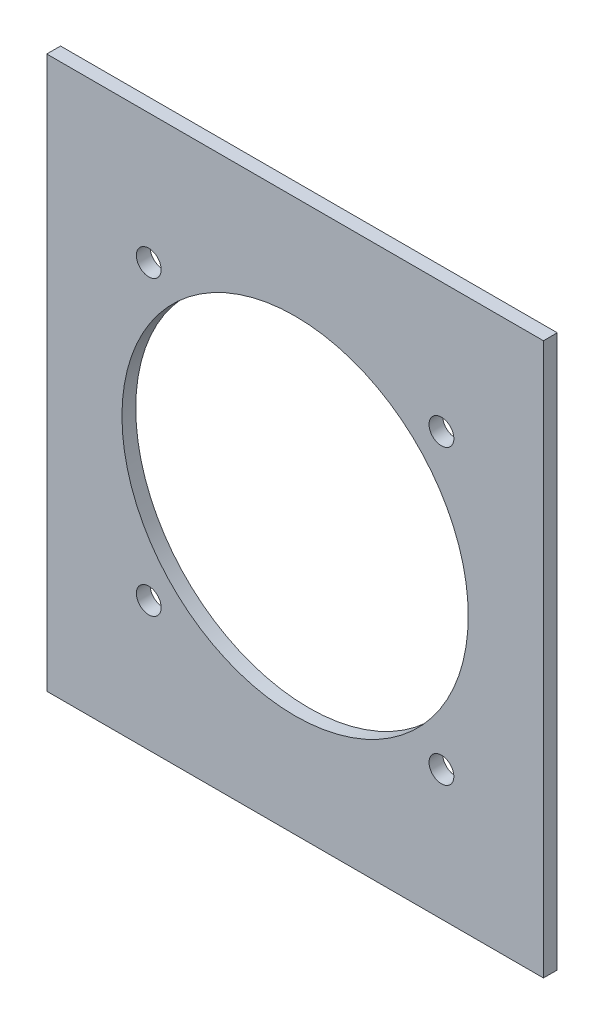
ISO-10303-21;
HEADER;
FILE_DESCRIPTION(('STEP AP214'),'2;1');
FILE_NAME('part.step','',(''),(''),'','','');
FILE_SCHEMA(('AUTOMOTIVE_DESIGN { 1 0 10303 214 1 1 1 1 }'));
ENDSEC;
DATA;
#1=APPLICATION_CONTEXT('core data for automotive mechanical design processes');
#2=APPLICATION_PROTOCOL_DEFINITION('international standard','automotive_design',2000,#1);
#3=PRODUCT_CONTEXT('',#1,'mechanical');
#4=PRODUCT('Part','Part','',(#3));
#5=PRODUCT_RELATED_PRODUCT_CATEGORY('part','',(#4));
#6=PRODUCT_DEFINITION_FORMATION('','',#4);
#7=PRODUCT_DEFINITION_CONTEXT('part definition',#1,'design');
#8=PRODUCT_DEFINITION('design','',#6,#7);
#9=PRODUCT_DEFINITION_SHAPE('','',#8);
#10=(LENGTH_UNIT() NAMED_UNIT(*) SI_UNIT(.MILLI.,.METRE.));
#11=(NAMED_UNIT(*) PLANE_ANGLE_UNIT() SI_UNIT($,.RADIAN.));
#12=(NAMED_UNIT(*) SI_UNIT($,.STERADIAN.) SOLID_ANGLE_UNIT());
#13=UNCERTAINTY_MEASURE_WITH_UNIT(LENGTH_MEASURE(1.E-05),#10,'distance_accuracy_value','');
#14=(GEOMETRIC_REPRESENTATION_CONTEXT(3) GLOBAL_UNCERTAINTY_ASSIGNED_CONTEXT((#13)) GLOBAL_UNIT_ASSIGNED_CONTEXT((#10,
#11,#12)) REPRESENTATION_CONTEXT('',''));
#15=CARTESIAN_POINT('',(0.,0.,0.));
#16=DIRECTION('',(0.,0.,1.));
#17=DIRECTION('',(1.,0.,0.));
#18=AXIS2_PLACEMENT_3D('',#15,#16,#17);
#19=CARTESIAN_POINT('',(-180.,-200.,9.99999999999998));
#20=DIRECTION('',(0.,0.,1.));
#21=DIRECTION('',(1.,0.,0.));
#22=AXIS2_PLACEMENT_3D('',#19,#20,#21);
#23=PLANE('',#22);
#24=CARTESIAN_POINT('',(-106.066017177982,-106.066017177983,9.9999999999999));
#25=DIRECTION('',(0.,0.,1.));
#26=DIRECTION('',(1.,0.,0.));
#27=AXIS2_PLACEMENT_3D('',#24,#25,#26);
#28=CIRCLE('',#27,8.99999999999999);
#29=CARTESIAN_POINT('',(-115.066017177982,-106.066017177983,9.9999999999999));
#30=VERTEX_POINT('',#29);
#31=EDGE_CURVE('E129',#30,#30,#28,.T.);
#32=ORIENTED_EDGE('',*,*,#31,.F.);
#33=EDGE_LOOP('',(#32));
#34=FACE_BOUND('',#33,.T.);
#35=CARTESIAN_POINT('',(106.066017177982,106.066017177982,10.0000000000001));
#36=DIRECTION('',(0.,0.,1.));
#37=DIRECTION('',(1.,0.,0.));
#38=AXIS2_PLACEMENT_3D('',#35,#36,#37);
#39=CIRCLE('',#38,8.99999999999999);
#40=CARTESIAN_POINT('',(97.0660171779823,106.066017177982,10.0000000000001));
#41=VERTEX_POINT('',#40);
#42=EDGE_CURVE('E143',#41,#41,#39,.T.);
#43=ORIENTED_EDGE('',*,*,#42,.F.);
#44=EDGE_LOOP('',(#43));
#45=FACE_BOUND('',#44,.T.);
#46=DIRECTION('',(0.,-1.,0.));
#47=VECTOR('',#46,1.);
#48=CARTESIAN_POINT('',(-180.,200.,9.99999999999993));
#49=LINE('',#48,#47);
#50=CARTESIAN_POINT('',(-180.,200.,9.99999999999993));
#51=VERTEX_POINT('',#50);
#52=CARTESIAN_POINT('',(-180.,-200.,9.99999999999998));
#53=VERTEX_POINT('',#52);
#54=EDGE_CURVE('E99',#51,#53,#49,.T.);
#55=ORIENTED_EDGE('',*,*,#54,.T.);
#56=DIRECTION('',(1.,0.,0.));
#57=VECTOR('',#56,1.);
#58=CARTESIAN_POINT('',(-180.,-200.,9.99999999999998));
#59=LINE('',#58,#57);
#60=CARTESIAN_POINT('',(180.,-200.,10.0000000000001));
#61=VERTEX_POINT('',#60);
#62=EDGE_CURVE('E84',#53,#61,#59,.T.);
#63=ORIENTED_EDGE('',*,*,#62,.T.);
#64=DIRECTION('',(0.,1.,0.));
#65=VECTOR('',#64,1.);
#66=CARTESIAN_POINT('',(180.,200.,10.0000000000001));
#67=LINE('',#66,#65);
#68=CARTESIAN_POINT('',(180.,200.,10.0000000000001));
#69=VERTEX_POINT('',#68);
#70=EDGE_CURVE('E50',#61,#69,#67,.T.);
#71=ORIENTED_EDGE('',*,*,#70,.T.);
#72=DIRECTION('',(-1.,0.,0.));
#73=VECTOR('',#72,1.);
#74=CARTESIAN_POINT('',(-180.,200.,9.99999999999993));
#75=LINE('',#74,#73);
#76=EDGE_CURVE('E45',#69,#51,#75,.T.);
#77=ORIENTED_EDGE('',*,*,#76,.T.);
#78=EDGE_LOOP('',(#55,#63,#71,#77));
#79=FACE_BOUND('',#78,.T.);
#80=CARTESIAN_POINT('',(0.,0.,10.));
#81=DIRECTION('',(0.,0.,1.));
#82=DIRECTION('',(1.,0.,0.));
#83=AXIS2_PLACEMENT_3D('',#80,#81,#82);
#84=CIRCLE('',#83,125.5);
#85=CARTESIAN_POINT('',(-125.5,0.,10.));
#86=VERTEX_POINT('',#85);
#87=EDGE_CURVE('E89',#86,#86,#84,.T.);
#88=ORIENTED_EDGE('',*,*,#87,.F.);
#89=EDGE_LOOP('',(#88));
#90=FACE_BOUND('',#89,.T.);
#91=CARTESIAN_POINT('',(-106.066017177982,106.066017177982,9.99999999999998));
#92=DIRECTION('',(0.,0.,1.));
#93=DIRECTION('',(1.,0.,0.));
#94=AXIS2_PLACEMENT_3D('',#91,#92,#93);
#95=CIRCLE('',#94,8.99999999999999);
#96=CARTESIAN_POINT('',(-115.066017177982,106.066017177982,9.99999999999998));
#97=VERTEX_POINT('',#96);
#98=EDGE_CURVE('E120',#97,#97,#95,.T.);
#99=ORIENTED_EDGE('',*,*,#98,.F.);
#100=EDGE_LOOP('',(#99));
#101=FACE_BOUND('',#100,.T.);
#102=CARTESIAN_POINT('',(106.066017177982,-106.066017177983,10.));
#103=DIRECTION('',(0.,0.,1.));
#104=DIRECTION('',(1.,0.,0.));
#105=AXIS2_PLACEMENT_3D('',#102,#103,#104);
#106=CIRCLE('',#105,9.00000000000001);
#107=CARTESIAN_POINT('',(97.0660171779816,-106.066017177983,10.));
#108=VERTEX_POINT('',#107);
#109=EDGE_CURVE('E123',#108,#108,#106,.T.);
#110=ORIENTED_EDGE('',*,*,#109,.F.);
#111=EDGE_LOOP('',(#110));
#112=FACE_BOUND('',#111,.T.);
#113=ADVANCED_FACE('F30',(#34,#45,#79,#90,#101,#112),#23,.T.);
#114=CARTESIAN_POINT('',(-180.,-200.,0.));
#115=DIRECTION('',(0.,0.,1.));
#116=DIRECTION('',(1.,0.,0.));
#117=AXIS2_PLACEMENT_3D('',#114,#115,#116);
#118=PLANE('',#117);
#119=CARTESIAN_POINT('',(-106.066017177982,-106.066017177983,-1.11022302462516E-13));
#120=DIRECTION('',(0.,0.,1.));
#121=DIRECTION('',(1.,0.,0.));
#122=AXIS2_PLACEMENT_3D('',#119,#120,#121);
#123=CIRCLE('',#122,8.99999999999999);
#124=CARTESIAN_POINT('',(-115.066017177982,-106.066017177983,-1.07552855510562E-13));
#125=VERTEX_POINT('',#124);
#126=EDGE_CURVE('E125',#125,#125,#123,.T.);
#127=ORIENTED_EDGE('',*,*,#126,.T.);
#128=EDGE_LOOP('',(#127));
#129=FACE_BOUND('',#128,.T.);
#130=CARTESIAN_POINT('',(106.066017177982,106.066017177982,1.11022302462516E-13));
#131=DIRECTION('',(0.,0.,1.));
#132=DIRECTION('',(1.,0.,0.));
#133=AXIS2_PLACEMENT_3D('',#130,#131,#132);
#134=CIRCLE('',#133,8.99999999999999);
#135=CARTESIAN_POINT('',(97.0660171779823,106.066017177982,1.14491749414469E-13));
#136=VERTEX_POINT('',#135);
#137=EDGE_CURVE('E140',#136,#136,#134,.T.);
#138=ORIENTED_EDGE('',*,*,#137,.T.);
#139=EDGE_LOOP('',(#138));
#140=FACE_BOUND('',#139,.T.);
#141=DIRECTION('',(0.,-1.,0.));
#142=VECTOR('',#141,1.);
#143=CARTESIAN_POINT('',(-180.,200.,0.));
#144=LINE('',#143,#142);
#145=CARTESIAN_POINT('',(-180.,200.,0.));
#146=VERTEX_POINT('',#145);
#147=CARTESIAN_POINT('',(-180.,-200.,0.));
#148=VERTEX_POINT('',#147);
#149=EDGE_CURVE('E76',#146,#148,#144,.T.);
#150=ORIENTED_EDGE('',*,*,#149,.F.);
#151=DIRECTION('',(-1.,0.,0.));
#152=VECTOR('',#151,1.);
#153=CARTESIAN_POINT('',(-180.,200.,0.));
#154=LINE('',#153,#152);
#155=CARTESIAN_POINT('',(180.,200.,1.11022302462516E-13));
#156=VERTEX_POINT('',#155);
#157=EDGE_CURVE('E97',#156,#146,#154,.T.);
#158=ORIENTED_EDGE('',*,*,#157,.F.);
#159=DIRECTION('',(0.,1.,0.));
#160=VECTOR('',#159,1.);
#161=CARTESIAN_POINT('',(180.,200.,1.11022302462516E-13));
#162=LINE('',#161,#160);
#163=CARTESIAN_POINT('',(180.,-200.,1.66533453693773E-13));
#164=VERTEX_POINT('',#163);
#165=EDGE_CURVE('E77',#164,#156,#162,.T.);
#166=ORIENTED_EDGE('',*,*,#165,.F.);
#167=DIRECTION('',(1.,0.,0.));
#168=VECTOR('',#167,1.);
#169=CARTESIAN_POINT('',(-180.,-200.,0.));
#170=LINE('',#169,#168);
#171=EDGE_CURVE('E71',#148,#164,#170,.T.);
#172=ORIENTED_EDGE('',*,*,#171,.F.);
#173=EDGE_LOOP('',(#150,#158,#166,#172));
#174=FACE_BOUND('',#173,.T.);
#175=CARTESIAN_POINT('',(0.,0.,0.));
#176=DIRECTION('',(0.,0.,1.));
#177=DIRECTION('',(1.,0.,0.));
#178=AXIS2_PLACEMENT_3D('',#175,#176,#177);
#179=CIRCLE('',#178,125.5);
#180=CARTESIAN_POINT('',(-125.5,0.,0.));
#181=VERTEX_POINT('',#180);
#182=EDGE_CURVE('E92',#181,#181,#179,.T.);
#183=ORIENTED_EDGE('',*,*,#182,.T.);
#184=EDGE_LOOP('',(#183));
#185=FACE_BOUND('',#184,.T.);
#186=CARTESIAN_POINT('',(-106.066017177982,106.066017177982,0.));
#187=DIRECTION('',(0.,0.,1.));
#188=DIRECTION('',(1.,0.,0.));
#189=AXIS2_PLACEMENT_3D('',#186,#187,#188);
#190=CIRCLE('',#189,8.99999999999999);
#191=CARTESIAN_POINT('',(-115.066017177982,106.066017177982,0.));
#192=VERTEX_POINT('',#191);
#193=EDGE_CURVE('E136',#192,#192,#190,.T.);
#194=ORIENTED_EDGE('',*,*,#193,.T.);
#195=EDGE_LOOP('',(#194));
#196=FACE_BOUND('',#195,.T.);
#197=CARTESIAN_POINT('',(106.066017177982,-106.066017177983,0.));
#198=DIRECTION('',(0.,0.,1.));
#199=DIRECTION('',(1.,0.,0.));
#200=AXIS2_PLACEMENT_3D('',#197,#198,#199);
#201=CIRCLE('',#200,9.00000000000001);
#202=CARTESIAN_POINT('',(97.0660171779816,-106.066017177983,0.));
#203=VERTEX_POINT('',#202);
#204=EDGE_CURVE('E126',#203,#203,#201,.T.);
#205=ORIENTED_EDGE('',*,*,#204,.T.);
#206=EDGE_LOOP('',(#205));
#207=FACE_BOUND('',#206,.T.);
#208=ADVANCED_FACE('F72',(#129,#140,#174,#185,#196,#207),#118,.F.);
#209=CARTESIAN_POINT('',(-180.,200.,9.99999999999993));
#210=DIRECTION('',(1.,0.,0.));
#211=DIRECTION('',(0.,1.,0.));
#212=AXIS2_PLACEMENT_3D('',#209,#210,#211);
#213=PLANE('',#212);
#214=ORIENTED_EDGE('',*,*,#149,.T.);
#215=DIRECTION('',(0.,0.,-1.));
#216=VECTOR('',#215,1.);
#217=CARTESIAN_POINT('',(-180.,-200.,9.99999999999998));
#218=LINE('',#217,#216);
#219=EDGE_CURVE('E11',#53,#148,#218,.T.);
#220=ORIENTED_EDGE('',*,*,#219,.F.);
#221=ORIENTED_EDGE('',*,*,#54,.F.);
#222=DIRECTION('',(0.,0.,-1.));
#223=VECTOR('',#222,1.);
#224=CARTESIAN_POINT('',(-180.,200.,9.99999999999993));
#225=LINE('',#224,#223);
#226=EDGE_CURVE('E88',#51,#146,#225,.T.);
#227=ORIENTED_EDGE('',*,*,#226,.T.);
#228=EDGE_LOOP('',(#214,#220,#221,#227));
#229=FACE_BOUND('',#228,.T.);
#230=ADVANCED_FACE('F32',(#229),#213,.F.);
#231=CARTESIAN_POINT('',(-180.,-200.,9.99999999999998));
#232=DIRECTION('',(0.,1.,0.));
#233=DIRECTION('',(0.,0.,1.));
#234=AXIS2_PLACEMENT_3D('',#231,#232,#233);
#235=PLANE('',#234);
#236=ORIENTED_EDGE('',*,*,#171,.T.);
#237=DIRECTION('',(0.,0.,-1.));
#238=VECTOR('',#237,1.);
#239=CARTESIAN_POINT('',(180.,-200.,10.0000000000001));
#240=LINE('',#239,#238);
#241=EDGE_CURVE('E38',#61,#164,#240,.T.);
#242=ORIENTED_EDGE('',*,*,#241,.F.);
#243=ORIENTED_EDGE('',*,*,#62,.F.);
#244=ORIENTED_EDGE('',*,*,#219,.T.);
#245=EDGE_LOOP('',(#236,#242,#243,#244));
#246=FACE_BOUND('',#245,.T.);
#247=ADVANCED_FACE('F83',(#246),#235,.F.);
#248=CARTESIAN_POINT('',(180.,200.,10.0000000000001));
#249=DIRECTION('',(-1.,0.,0.));
#250=DIRECTION('',(0.,-1.,0.));
#251=AXIS2_PLACEMENT_3D('',#248,#249,#250);
#252=PLANE('',#251);
#253=ORIENTED_EDGE('',*,*,#165,.T.);
#254=DIRECTION('',(0.,0.,-1.));
#255=VECTOR('',#254,1.);
#256=CARTESIAN_POINT('',(180.,200.,10.0000000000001));
#257=LINE('',#256,#255);
#258=EDGE_CURVE('E105',#69,#156,#257,.T.);
#259=ORIENTED_EDGE('',*,*,#258,.F.);
#260=ORIENTED_EDGE('',*,*,#70,.F.);
#261=ORIENTED_EDGE('',*,*,#241,.T.);
#262=EDGE_LOOP('',(#253,#259,#260,#261));
#263=FACE_BOUND('',#262,.T.);
#264=ADVANCED_FACE('F108',(#263),#252,.F.);
#265=CARTESIAN_POINT('',(-180.,200.,9.99999999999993));
#266=DIRECTION('',(0.,-1.,0.));
#267=DIRECTION('',(0.,0.,-1.));
#268=AXIS2_PLACEMENT_3D('',#265,#266,#267);
#269=PLANE('',#268);
#270=ORIENTED_EDGE('',*,*,#157,.T.);
#271=ORIENTED_EDGE('',*,*,#226,.F.);
#272=ORIENTED_EDGE('',*,*,#76,.F.);
#273=ORIENTED_EDGE('',*,*,#258,.T.);
#274=EDGE_LOOP('',(#270,#271,#272,#273));
#275=FACE_BOUND('',#274,.T.);
#276=ADVANCED_FACE('F110',(#275),#269,.F.);
#277=CARTESIAN_POINT('',(0.,0.,10.));
#278=DIRECTION('',(0.,0.,-1.));
#279=DIRECTION('',(-1.,0.,0.));
#280=AXIS2_PLACEMENT_3D('',#277,#278,#279);
#281=CYLINDRICAL_SURFACE('',#280,125.5);
#282=CARTESIAN_POINT('',(-125.5,0.,10.));
#283=CARTESIAN_POINT('',(-125.5,0.,9.89583333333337));
#284=CARTESIAN_POINT('',(-125.5,0.,9.7916666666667));
#285=CARTESIAN_POINT('',(-125.5,0.,9.58333333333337));
#286=CARTESIAN_POINT('',(-125.5,0.,9.47916666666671));
#287=CARTESIAN_POINT('',(-125.5,0.,9.27083333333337));
#288=CARTESIAN_POINT('',(-125.5,0.,9.16666666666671));
#289=CARTESIAN_POINT('',(-125.5,0.,8.95833333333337));
#290=CARTESIAN_POINT('',(-125.5,0.,8.85416666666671));
#291=CARTESIAN_POINT('',(-125.5,0.,8.64583333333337));
#292=CARTESIAN_POINT('',(-125.5,0.,8.54166666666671));
#293=CARTESIAN_POINT('',(-125.5,0.,8.33333333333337));
#294=CARTESIAN_POINT('',(-125.5,0.,8.2291666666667));
#295=CARTESIAN_POINT('',(-125.5,0.,8.02083333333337));
#296=CARTESIAN_POINT('',(-125.5,0.,7.9166666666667));
#297=CARTESIAN_POINT('',(-125.5,0.,7.70833333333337));
#298=CARTESIAN_POINT('',(-125.5,0.,7.6041666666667));
#299=CARTESIAN_POINT('',(-125.5,0.,7.39583333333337));
#300=CARTESIAN_POINT('',(-125.5,0.,7.2916666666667));
#301=CARTESIAN_POINT('',(-125.5,0.,7.08333333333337));
#302=CARTESIAN_POINT('',(-125.5,0.,6.9791666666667));
#303=CARTESIAN_POINT('',(-125.5,0.,6.77083333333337));
#304=CARTESIAN_POINT('',(-125.5,0.,6.6666666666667));
#305=CARTESIAN_POINT('',(-125.5,0.,6.45833333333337));
#306=CARTESIAN_POINT('',(-125.5,0.,6.3541666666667));
#307=CARTESIAN_POINT('',(-125.5,0.,6.14583333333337));
#308=CARTESIAN_POINT('',(-125.5,0.,6.0416666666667));
#309=CARTESIAN_POINT('',(-125.5,0.,5.83333333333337));
#310=CARTESIAN_POINT('',(-125.5,0.,5.7291666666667));
#311=CARTESIAN_POINT('',(-125.5,0.,5.52083333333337));
#312=CARTESIAN_POINT('',(-125.5,0.,5.4166666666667));
#313=CARTESIAN_POINT('',(-125.5,0.,5.20833333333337));
#314=CARTESIAN_POINT('',(-125.5,0.,5.1041666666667));
#315=CARTESIAN_POINT('',(-125.5,0.,4.89583333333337));
#316=CARTESIAN_POINT('',(-125.5,0.,4.7916666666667));
#317=CARTESIAN_POINT('',(-125.5,0.,4.58333333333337));
#318=CARTESIAN_POINT('',(-125.5,0.,4.4791666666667));
#319=CARTESIAN_POINT('',(-125.5,0.,4.27083333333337));
#320=CARTESIAN_POINT('',(-125.5,0.,4.1666666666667));
#321=CARTESIAN_POINT('',(-125.5,0.,3.95833333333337));
#322=CARTESIAN_POINT('',(-125.5,0.,3.8541666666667));
#323=CARTESIAN_POINT('',(-125.5,0.,3.64583333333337));
#324=CARTESIAN_POINT('',(-125.5,0.,3.5416666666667));
#325=CARTESIAN_POINT('',(-125.5,0.,3.33333333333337));
#326=CARTESIAN_POINT('',(-125.5,0.,3.2291666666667));
#327=CARTESIAN_POINT('',(-125.5,0.,3.02083333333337));
#328=CARTESIAN_POINT('',(-125.5,0.,2.9166666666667));
#329=CARTESIAN_POINT('',(-125.5,0.,2.70833333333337));
#330=CARTESIAN_POINT('',(-125.5,0.,2.6041666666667));
#331=CARTESIAN_POINT('',(-125.5,0.,2.39583333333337));
#332=CARTESIAN_POINT('',(-125.5,0.,2.2916666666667));
#333=CARTESIAN_POINT('',(-125.5,0.,2.08333333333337));
#334=CARTESIAN_POINT('',(-125.5,0.,1.9791666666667));
#335=CARTESIAN_POINT('',(-125.5,0.,1.77083333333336));
#336=CARTESIAN_POINT('',(-125.5,0.,1.6666666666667));
#337=CARTESIAN_POINT('',(-125.5,0.,1.45833333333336));
#338=CARTESIAN_POINT('',(-125.5,0.,1.3541666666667));
#339=CARTESIAN_POINT('',(-125.5,0.,1.14583333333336));
#340=CARTESIAN_POINT('',(-125.5,0.,1.0416666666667));
#341=CARTESIAN_POINT('',(-125.5,0.,0.833333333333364));
#342=CARTESIAN_POINT('',(-125.5,0.,0.729166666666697));
#343=CARTESIAN_POINT('',(-125.5,0.,0.520833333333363));
#344=CARTESIAN_POINT('',(-125.5,0.,0.416666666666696));
#345=CARTESIAN_POINT('',(-125.5,0.,0.208333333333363));
#346=CARTESIAN_POINT('',(-125.5,0.,0.104166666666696));
#347=CARTESIAN_POINT('',(-125.5,0.,0.));
#348=B_SPLINE_CURVE_WITH_KNOTS('',3,(#282,#283,#284,#285,#286,#287,#288,#289,#290,#291,#292,
#293,#294,#295,#296,#297,#298,#299,#300,#301,#302,#303,#304,#305,#306,#307,#308,#309,#310,#311,
#312,#313,#314,#315,#316,#317,#318,#319,#320,#321,#322,#323,#324,#325,#326,#327,#328,#329,#330,
#331,#332,#333,#334,#335,#336,#337,#338,#339,#340,#341,#342,#343,#344,#345,#346,#347),
.UNSPECIFIED.,.F.,.F.,(4,2,2,2,2,2,2,2,2,2,2,2,2,2,2,2,2,2,2,2,2,2,2,2,2,2,2,2,2,2,2,2,4),(0.,
0.312499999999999,0.624999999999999,0.937499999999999,1.25,1.5625,1.875,2.1875,2.5,2.8125,3.125,
3.4375,3.75,4.0625,4.375,4.6875,5.,5.3125,5.625,5.9375,6.25,6.5625,6.875,7.1875,7.5,7.8125,
8.125,8.4375,8.75,9.06250000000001,9.37500000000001,9.68750000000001,10.),.UNSPECIFIED.);
#349=EDGE_CURVE('BSEAM149',#86,#181,#348,.T.);
#350=ORIENTED_EDGE('',*,*,#87,.T.);
#351=ORIENTED_EDGE('',*,*,#182,.F.);
#352=ORIENTED_EDGE('',*,*,#349,.T.);
#353=ORIENTED_EDGE('',*,*,#349,.F.);
#354=EDGE_LOOP('',(#350,#352,#351,#353));
#355=FACE_BOUND('',#354,.T.);
#356=ADVANCED_FACE('F149',(#355),#281,.F.);
#357=CARTESIAN_POINT('',(106.066017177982,106.066017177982,10.0000000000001));
#358=DIRECTION('',(0.,0.,-1.));
#359=DIRECTION('',(-1.,0.,0.));
#360=AXIS2_PLACEMENT_3D('',#357,#358,#359);
#361=CYLINDRICAL_SURFACE('',#360,8.99999999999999);
#362=CARTESIAN_POINT('',(97.0660171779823,106.066017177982,10.0000000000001));
#363=CARTESIAN_POINT('',(97.0660171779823,106.066017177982,9.89583333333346));
#364=CARTESIAN_POINT('',(97.0660171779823,106.066017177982,9.79166666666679));
#365=CARTESIAN_POINT('',(97.0660171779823,106.066017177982,9.58333333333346));
#366=CARTESIAN_POINT('',(97.0660171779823,106.066017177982,9.47916666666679));
#367=CARTESIAN_POINT('',(97.0660171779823,106.066017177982,9.27083333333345));
#368=CARTESIAN_POINT('',(97.0660171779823,106.066017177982,9.16666666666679));
#369=CARTESIAN_POINT('',(97.0660171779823,106.066017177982,8.95833333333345));
#370=CARTESIAN_POINT('',(97.0660171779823,106.066017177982,8.85416666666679));
#371=CARTESIAN_POINT('',(97.0660171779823,106.066017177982,8.64583333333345));
#372=CARTESIAN_POINT('',(97.0660171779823,106.066017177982,8.54166666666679));
#373=CARTESIAN_POINT('',(97.0660171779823,106.066017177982,8.33333333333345));
#374=CARTESIAN_POINT('',(97.0660171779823,106.066017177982,8.22916666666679));
#375=CARTESIAN_POINT('',(97.0660171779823,106.066017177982,8.02083333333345));
#376=CARTESIAN_POINT('',(97.0660171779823,106.066017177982,7.91666666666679));
#377=CARTESIAN_POINT('',(97.0660171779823,106.066017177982,7.70833333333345));
#378=CARTESIAN_POINT('',(97.0660171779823,106.066017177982,7.60416666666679));
#379=CARTESIAN_POINT('',(97.0660171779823,106.066017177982,7.39583333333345));
#380=CARTESIAN_POINT('',(97.0660171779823,106.066017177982,7.29166666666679));
#381=CARTESIAN_POINT('',(97.0660171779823,106.066017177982,7.08333333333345));
#382=CARTESIAN_POINT('',(97.0660171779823,106.066017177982,6.97916666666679));
#383=CARTESIAN_POINT('',(97.0660171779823,106.066017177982,6.77083333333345));
#384=CARTESIAN_POINT('',(97.0660171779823,106.066017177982,6.66666666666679));
#385=CARTESIAN_POINT('',(97.0660171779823,106.066017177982,6.45833333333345));
#386=CARTESIAN_POINT('',(97.0660171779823,106.066017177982,6.35416666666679));
#387=CARTESIAN_POINT('',(97.0660171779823,106.066017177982,6.14583333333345));
#388=CARTESIAN_POINT('',(97.0660171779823,106.066017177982,6.04166666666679));
#389=CARTESIAN_POINT('',(97.0660171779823,106.066017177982,5.83333333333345));
#390=CARTESIAN_POINT('',(97.0660171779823,106.066017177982,5.72916666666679));
#391=CARTESIAN_POINT('',(97.0660171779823,106.066017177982,5.52083333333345));
#392=CARTESIAN_POINT('',(97.0660171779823,106.066017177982,5.41666666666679));
#393=CARTESIAN_POINT('',(97.0660171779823,106.066017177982,5.20833333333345));
#394=CARTESIAN_POINT('',(97.0660171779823,106.066017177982,5.10416666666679));
#395=CARTESIAN_POINT('',(97.0660171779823,106.066017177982,4.89583333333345));
#396=CARTESIAN_POINT('',(97.0660171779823,106.066017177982,4.79166666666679));
#397=CARTESIAN_POINT('',(97.0660171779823,106.066017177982,4.58333333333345));
#398=CARTESIAN_POINT('',(97.0660171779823,106.066017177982,4.47916666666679));
#399=CARTESIAN_POINT('',(97.0660171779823,106.066017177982,4.27083333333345));
#400=CARTESIAN_POINT('',(97.0660171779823,106.066017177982,4.16666666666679));
#401=CARTESIAN_POINT('',(97.0660171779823,106.066017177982,3.95833333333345));
#402=CARTESIAN_POINT('',(97.0660171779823,106.066017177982,3.85416666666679));
#403=CARTESIAN_POINT('',(97.0660171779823,106.066017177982,3.64583333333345));
#404=CARTESIAN_POINT('',(97.0660171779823,106.066017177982,3.54166666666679));
#405=CARTESIAN_POINT('',(97.0660171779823,106.066017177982,3.33333333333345));
#406=CARTESIAN_POINT('',(97.0660171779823,106.066017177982,3.22916666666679));
#407=CARTESIAN_POINT('',(97.0660171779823,106.066017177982,3.02083333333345));
#408=CARTESIAN_POINT('',(97.0660171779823,106.066017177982,2.91666666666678));
#409=CARTESIAN_POINT('',(97.0660171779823,106.066017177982,2.70833333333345));
#410=CARTESIAN_POINT('',(97.0660171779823,106.066017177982,2.60416666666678));
#411=CARTESIAN_POINT('',(97.0660171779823,106.066017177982,2.39583333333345));
#412=CARTESIAN_POINT('',(97.0660171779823,106.066017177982,2.29166666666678));
#413=CARTESIAN_POINT('',(97.0660171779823,106.066017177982,2.08333333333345));
#414=CARTESIAN_POINT('',(97.0660171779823,106.066017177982,1.97916666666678));
#415=CARTESIAN_POINT('',(97.0660171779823,106.066017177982,1.77083333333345));
#416=CARTESIAN_POINT('',(97.0660171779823,106.066017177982,1.66666666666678));
#417=CARTESIAN_POINT('',(97.0660171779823,106.066017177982,1.45833333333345));
#418=CARTESIAN_POINT('',(97.0660171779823,106.066017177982,1.35416666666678));
#419=CARTESIAN_POINT('',(97.0660171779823,106.066017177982,1.14583333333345));
#420=CARTESIAN_POINT('',(97.0660171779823,106.066017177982,1.04166666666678));
#421=CARTESIAN_POINT('',(97.0660171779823,106.066017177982,0.833333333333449));
#422=CARTESIAN_POINT('',(97.0660171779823,106.066017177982,0.729166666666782));
#423=CARTESIAN_POINT('',(97.0660171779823,106.066017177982,0.520833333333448));
#424=CARTESIAN_POINT('',(97.0660171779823,106.066017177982,0.416666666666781));
#425=CARTESIAN_POINT('',(97.0660171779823,106.066017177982,0.208333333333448));
#426=CARTESIAN_POINT('',(97.0660171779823,106.066017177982,0.104166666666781));
#427=CARTESIAN_POINT('',(97.0660171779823,106.066017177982,1.14491749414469E-13));
#428=B_SPLINE_CURVE_WITH_KNOTS('',3,(#362,#363,#364,#365,#366,#367,#368,#369,#370,#371,#372,
#373,#374,#375,#376,#377,#378,#379,#380,#381,#382,#383,#384,#385,#386,#387,#388,#389,#390,#391,
#392,#393,#394,#395,#396,#397,#398,#399,#400,#401,#402,#403,#404,#405,#406,#407,#408,#409,#410,
#411,#412,#413,#414,#415,#416,#417,#418,#419,#420,#421,#422,#423,#424,#425,#426,#427),
.UNSPECIFIED.,.F.,.F.,(4,2,2,2,2,2,2,2,2,2,2,2,2,2,2,2,2,2,2,2,2,2,2,2,2,2,2,2,2,2,2,2,4),(0.,
0.312499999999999,0.624999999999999,0.937499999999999,1.25,1.5625,1.875,2.1875,2.5,2.8125,3.125,
3.4375,3.75,4.0625,4.375,4.6875,5.,5.3125,5.625,5.9375,6.25,6.5625,6.875,7.1875,7.5,
7.81250000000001,8.12500000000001,8.43750000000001,8.75000000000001,9.06250000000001,
9.37500000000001,9.68750000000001,10.),.UNSPECIFIED.);
#429=EDGE_CURVE('BSEAM151',#41,#136,#428,.T.);
#430=ORIENTED_EDGE('',*,*,#42,.T.);
#431=ORIENTED_EDGE('',*,*,#137,.F.);
#432=ORIENTED_EDGE('',*,*,#429,.T.);
#433=ORIENTED_EDGE('',*,*,#429,.F.);
#434=EDGE_LOOP('',(#430,#432,#431,#433));
#435=FACE_BOUND('',#434,.T.);
#436=ADVANCED_FACE('F151',(#435),#361,.F.);
#437=CARTESIAN_POINT('',(-106.066017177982,106.066017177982,9.99999999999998));
#438=DIRECTION('',(0.,0.,-1.));
#439=DIRECTION('',(-1.,0.,0.));
#440=AXIS2_PLACEMENT_3D('',#437,#438,#439);
#441=CYLINDRICAL_SURFACE('',#440,8.99999999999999);
#442=CARTESIAN_POINT('',(-115.066017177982,106.066017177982,9.99999999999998));
#443=CARTESIAN_POINT('',(-115.066017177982,106.066017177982,9.89583333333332));
#444=CARTESIAN_POINT('',(-115.066017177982,106.066017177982,9.79166666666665));
#445=CARTESIAN_POINT('',(-115.066017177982,106.066017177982,9.58333333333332));
#446=CARTESIAN_POINT('',(-115.066017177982,106.066017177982,9.47916666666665));
#447=CARTESIAN_POINT('',(-115.066017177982,106.066017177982,9.27083333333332));
#448=CARTESIAN_POINT('',(-115.066017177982,106.066017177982,9.16666666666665));
#449=CARTESIAN_POINT('',(-115.066017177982,106.066017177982,8.95833333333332));
#450=CARTESIAN_POINT('',(-115.066017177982,106.066017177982,8.85416666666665));
#451=CARTESIAN_POINT('',(-115.066017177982,106.066017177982,8.64583333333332));
#452=CARTESIAN_POINT('',(-115.066017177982,106.066017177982,8.54166666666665));
#453=CARTESIAN_POINT('',(-115.066017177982,106.066017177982,8.33333333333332));
#454=CARTESIAN_POINT('',(-115.066017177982,106.066017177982,8.22916666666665));
#455=CARTESIAN_POINT('',(-115.066017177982,106.066017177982,8.02083333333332));
#456=CARTESIAN_POINT('',(-115.066017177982,106.066017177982,7.91666666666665));
#457=CARTESIAN_POINT('',(-115.066017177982,106.066017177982,7.70833333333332));
#458=CARTESIAN_POINT('',(-115.066017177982,106.066017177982,7.60416666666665));
#459=CARTESIAN_POINT('',(-115.066017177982,106.066017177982,7.39583333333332));
#460=CARTESIAN_POINT('',(-115.066017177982,106.066017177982,7.29166666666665));
#461=CARTESIAN_POINT('',(-115.066017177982,106.066017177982,7.08333333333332));
#462=CARTESIAN_POINT('',(-115.066017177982,106.066017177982,6.97916666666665));
#463=CARTESIAN_POINT('',(-115.066017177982,106.066017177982,6.77083333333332));
#464=CARTESIAN_POINT('',(-115.066017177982,106.066017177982,6.66666666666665));
#465=CARTESIAN_POINT('',(-115.066017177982,106.066017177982,6.45833333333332));
#466=CARTESIAN_POINT('',(-115.066017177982,106.066017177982,6.35416666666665));
#467=CARTESIAN_POINT('',(-115.066017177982,106.066017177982,6.14583333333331));
#468=CARTESIAN_POINT('',(-115.066017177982,106.066017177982,6.04166666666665));
#469=CARTESIAN_POINT('',(-115.066017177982,106.066017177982,5.83333333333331));
#470=CARTESIAN_POINT('',(-115.066017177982,106.066017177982,5.72916666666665));
#471=CARTESIAN_POINT('',(-115.066017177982,106.066017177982,5.52083333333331));
#472=CARTESIAN_POINT('',(-115.066017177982,106.066017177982,5.41666666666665));
#473=CARTESIAN_POINT('',(-115.066017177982,106.066017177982,5.20833333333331));
#474=CARTESIAN_POINT('',(-115.066017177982,106.066017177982,5.10416666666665));
#475=CARTESIAN_POINT('',(-115.066017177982,106.066017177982,4.89583333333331));
#476=CARTESIAN_POINT('',(-115.066017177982,106.066017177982,4.79166666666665));
#477=CARTESIAN_POINT('',(-115.066017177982,106.066017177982,4.58333333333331));
#478=CARTESIAN_POINT('',(-115.066017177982,106.066017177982,4.47916666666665));
#479=CARTESIAN_POINT('',(-115.066017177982,106.066017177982,4.27083333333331));
#480=CARTESIAN_POINT('',(-115.066017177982,106.066017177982,4.16666666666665));
#481=CARTESIAN_POINT('',(-115.066017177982,106.066017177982,3.95833333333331));
#482=CARTESIAN_POINT('',(-115.066017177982,106.066017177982,3.85416666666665));
#483=CARTESIAN_POINT('',(-115.066017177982,106.066017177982,3.64583333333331));
#484=CARTESIAN_POINT('',(-115.066017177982,106.066017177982,3.54166666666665));
#485=CARTESIAN_POINT('',(-115.066017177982,106.066017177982,3.33333333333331));
#486=CARTESIAN_POINT('',(-115.066017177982,106.066017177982,3.22916666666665));
#487=CARTESIAN_POINT('',(-115.066017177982,106.066017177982,3.02083333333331));
#488=CARTESIAN_POINT('',(-115.066017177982,106.066017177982,2.91666666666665));
#489=CARTESIAN_POINT('',(-115.066017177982,106.066017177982,2.70833333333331));
#490=CARTESIAN_POINT('',(-115.066017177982,106.066017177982,2.60416666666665));
#491=CARTESIAN_POINT('',(-115.066017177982,106.066017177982,2.39583333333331));
#492=CARTESIAN_POINT('',(-115.066017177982,106.066017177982,2.29166666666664));
#493=CARTESIAN_POINT('',(-115.066017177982,106.066017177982,2.08333333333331));
#494=CARTESIAN_POINT('',(-115.066017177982,106.066017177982,1.97916666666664));
#495=CARTESIAN_POINT('',(-115.066017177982,106.066017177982,1.77083333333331));
#496=CARTESIAN_POINT('',(-115.066017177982,106.066017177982,1.66666666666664));
#497=CARTESIAN_POINT('',(-115.066017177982,106.066017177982,1.45833333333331));
#498=CARTESIAN_POINT('',(-115.066017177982,106.066017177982,1.35416666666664));
#499=CARTESIAN_POINT('',(-115.066017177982,106.066017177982,1.14583333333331));
#500=CARTESIAN_POINT('',(-115.066017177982,106.066017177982,1.04166666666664));
#501=CARTESIAN_POINT('',(-115.066017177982,106.066017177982,0.83333333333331));
#502=CARTESIAN_POINT('',(-115.066017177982,106.066017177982,0.729166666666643));
#503=CARTESIAN_POINT('',(-115.066017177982,106.066017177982,0.52083333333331));
#504=CARTESIAN_POINT('',(-115.066017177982,106.066017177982,0.416666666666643));
#505=CARTESIAN_POINT('',(-115.066017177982,106.066017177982,0.208333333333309));
#506=CARTESIAN_POINT('',(-115.066017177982,106.066017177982,0.104166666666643));
#507=CARTESIAN_POINT('',(-115.066017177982,106.066017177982,0.));
#508=B_SPLINE_CURVE_WITH_KNOTS('',3,(#442,#443,#444,#445,#446,#447,#448,#449,#450,#451,#452,
#453,#454,#455,#456,#457,#458,#459,#460,#461,#462,#463,#464,#465,#466,#467,#468,#469,#470,#471,
#472,#473,#474,#475,#476,#477,#478,#479,#480,#481,#482,#483,#484,#485,#486,#487,#488,#489,#490,
#491,#492,#493,#494,#495,#496,#497,#498,#499,#500,#501,#502,#503,#504,#505,#506,#507),
.UNSPECIFIED.,.F.,.F.,(4,2,2,2,2,2,2,2,2,2,2,2,2,2,2,2,2,2,2,2,2,2,2,2,2,2,2,2,2,2,2,2,4),(0.,
0.312499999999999,0.624999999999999,0.937499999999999,1.25,1.5625,1.875,2.1875,2.5,2.8125,3.125,
3.4375,3.75,4.0625,4.375,4.6875,5.,5.3125,5.625,5.9375,6.25,6.5625,6.875,7.1875,7.5,
7.81250000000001,8.12500000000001,8.43750000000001,8.75000000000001,9.06250000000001,
9.37500000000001,9.68750000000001,10.),.UNSPECIFIED.);
#509=EDGE_CURVE('BSEAM158',#97,#192,#508,.T.);
#510=ORIENTED_EDGE('',*,*,#98,.T.);
#511=ORIENTED_EDGE('',*,*,#193,.F.);
#512=ORIENTED_EDGE('',*,*,#509,.T.);
#513=ORIENTED_EDGE('',*,*,#509,.F.);
#514=EDGE_LOOP('',(#510,#512,#511,#513));
#515=FACE_BOUND('',#514,.T.);
#516=ADVANCED_FACE('F158',(#515),#441,.F.);
#517=CARTESIAN_POINT('',(-106.066017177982,-106.066017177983,9.9999999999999));
#518=DIRECTION('',(0.,0.,-1.));
#519=DIRECTION('',(-1.,0.,0.));
#520=AXIS2_PLACEMENT_3D('',#517,#518,#519);
#521=CYLINDRICAL_SURFACE('',#520,8.99999999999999);
#522=CARTESIAN_POINT('',(-115.066017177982,-106.066017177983,9.9999999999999));
#523=CARTESIAN_POINT('',(-115.066017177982,-106.066017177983,9.89583333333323));
#524=CARTESIAN_POINT('',(-115.066017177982,-106.066017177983,9.79166666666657));
#525=CARTESIAN_POINT('',(-115.066017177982,-106.066017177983,9.58333333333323));
#526=CARTESIAN_POINT('',(-115.066017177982,-106.066017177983,9.47916666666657));
#527=CARTESIAN_POINT('',(-115.066017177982,-106.066017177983,9.27083333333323));
#528=CARTESIAN_POINT('',(-115.066017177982,-106.066017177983,9.16666666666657));
#529=CARTESIAN_POINT('',(-115.066017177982,-106.066017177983,8.95833333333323));
#530=CARTESIAN_POINT('',(-115.066017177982,-106.066017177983,8.85416666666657));
#531=CARTESIAN_POINT('',(-115.066017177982,-106.066017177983,8.64583333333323));
#532=CARTESIAN_POINT('',(-115.066017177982,-106.066017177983,8.54166666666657));
#533=CARTESIAN_POINT('',(-115.066017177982,-106.066017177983,8.33333333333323));
#534=CARTESIAN_POINT('',(-115.066017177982,-106.066017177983,8.22916666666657));
#535=CARTESIAN_POINT('',(-115.066017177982,-106.066017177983,8.02083333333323));
#536=CARTESIAN_POINT('',(-115.066017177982,-106.066017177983,7.91666666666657));
#537=CARTESIAN_POINT('',(-115.066017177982,-106.066017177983,7.70833333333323));
#538=CARTESIAN_POINT('',(-115.066017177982,-106.066017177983,7.60416666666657));
#539=CARTESIAN_POINT('',(-115.066017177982,-106.066017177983,7.39583333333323));
#540=CARTESIAN_POINT('',(-115.066017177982,-106.066017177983,7.29166666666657));
#541=CARTESIAN_POINT('',(-115.066017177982,-106.066017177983,7.08333333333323));
#542=CARTESIAN_POINT('',(-115.066017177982,-106.066017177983,6.97916666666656));
#543=CARTESIAN_POINT('',(-115.066017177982,-106.066017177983,6.77083333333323));
#544=CARTESIAN_POINT('',(-115.066017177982,-106.066017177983,6.66666666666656));
#545=CARTESIAN_POINT('',(-115.066017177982,-106.066017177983,6.45833333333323));
#546=CARTESIAN_POINT('',(-115.066017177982,-106.066017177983,6.35416666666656));
#547=CARTESIAN_POINT('',(-115.066017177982,-106.066017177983,6.14583333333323));
#548=CARTESIAN_POINT('',(-115.066017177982,-106.066017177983,6.04166666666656));
#549=CARTESIAN_POINT('',(-115.066017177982,-106.066017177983,5.83333333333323));
#550=CARTESIAN_POINT('',(-115.066017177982,-106.066017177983,5.72916666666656));
#551=CARTESIAN_POINT('',(-115.066017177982,-106.066017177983,5.52083333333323));
#552=CARTESIAN_POINT('',(-115.066017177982,-106.066017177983,5.41666666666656));
#553=CARTESIAN_POINT('',(-115.066017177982,-106.066017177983,5.20833333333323));
#554=CARTESIAN_POINT('',(-115.066017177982,-106.066017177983,5.10416666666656));
#555=CARTESIAN_POINT('',(-115.066017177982,-106.066017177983,4.89583333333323));
#556=CARTESIAN_POINT('',(-115.066017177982,-106.066017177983,4.79166666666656));
#557=CARTESIAN_POINT('',(-115.066017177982,-106.066017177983,4.58333333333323));
#558=CARTESIAN_POINT('',(-115.066017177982,-106.066017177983,4.47916666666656));
#559=CARTESIAN_POINT('',(-115.066017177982,-106.066017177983,4.27083333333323));
#560=CARTESIAN_POINT('',(-115.066017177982,-106.066017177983,4.16666666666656));
#561=CARTESIAN_POINT('',(-115.066017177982,-106.066017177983,3.95833333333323));
#562=CARTESIAN_POINT('',(-115.066017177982,-106.066017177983,3.85416666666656));
#563=CARTESIAN_POINT('',(-115.066017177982,-106.066017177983,3.64583333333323));
#564=CARTESIAN_POINT('',(-115.066017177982,-106.066017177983,3.54166666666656));
#565=CARTESIAN_POINT('',(-115.066017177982,-106.066017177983,3.33333333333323));
#566=CARTESIAN_POINT('',(-115.066017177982,-106.066017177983,3.22916666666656));
#567=CARTESIAN_POINT('',(-115.066017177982,-106.066017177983,3.02083333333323));
#568=CARTESIAN_POINT('',(-115.066017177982,-106.066017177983,2.91666666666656));
#569=CARTESIAN_POINT('',(-115.066017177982,-106.066017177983,2.70833333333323));
#570=CARTESIAN_POINT('',(-115.066017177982,-106.066017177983,2.60416666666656));
#571=CARTESIAN_POINT('',(-115.066017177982,-106.066017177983,2.39583333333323));
#572=CARTESIAN_POINT('',(-115.066017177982,-106.066017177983,2.29166666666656));
#573=CARTESIAN_POINT('',(-115.066017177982,-106.066017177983,2.08333333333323));
#574=CARTESIAN_POINT('',(-115.066017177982,-106.066017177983,1.97916666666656));
#575=CARTESIAN_POINT('',(-115.066017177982,-106.066017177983,1.77083333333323));
#576=CARTESIAN_POINT('',(-115.066017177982,-106.066017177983,1.66666666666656));
#577=CARTESIAN_POINT('',(-115.066017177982,-106.066017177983,1.45833333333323));
#578=CARTESIAN_POINT('',(-115.066017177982,-106.066017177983,1.35416666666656));
#579=CARTESIAN_POINT('',(-115.066017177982,-106.066017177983,1.14583333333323));
#580=CARTESIAN_POINT('',(-115.066017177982,-106.066017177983,1.04166666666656));
#581=CARTESIAN_POINT('',(-115.066017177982,-106.066017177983,0.833333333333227));
#582=CARTESIAN_POINT('',(-115.066017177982,-106.066017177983,0.72916666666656));
#583=CARTESIAN_POINT('',(-115.066017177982,-106.066017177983,0.520833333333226));
#584=CARTESIAN_POINT('',(-115.066017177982,-106.066017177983,0.416666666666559));
#585=CARTESIAN_POINT('',(-115.066017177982,-106.066017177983,0.208333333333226));
#586=CARTESIAN_POINT('',(-115.066017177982,-106.066017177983,0.104166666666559));
#587=CARTESIAN_POINT('',(-115.066017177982,-106.066017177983,-1.07552855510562E-13));
#588=B_SPLINE_CURVE_WITH_KNOTS('',3,(#522,#523,#524,#525,#526,#527,#528,#529,#530,#531,#532,
#533,#534,#535,#536,#537,#538,#539,#540,#541,#542,#543,#544,#545,#546,#547,#548,#549,#550,#551,
#552,#553,#554,#555,#556,#557,#558,#559,#560,#561,#562,#563,#564,#565,#566,#567,#568,#569,#570,
#571,#572,#573,#574,#575,#576,#577,#578,#579,#580,#581,#582,#583,#584,#585,#586,#587),
.UNSPECIFIED.,.F.,.F.,(4,2,2,2,2,2,2,2,2,2,2,2,2,2,2,2,2,2,2,2,2,2,2,2,2,2,2,2,2,2,2,2,4),(0.,
0.312499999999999,0.624999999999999,0.937499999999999,1.25,1.5625,1.875,2.1875,2.5,2.8125,3.125,
3.4375,3.75,4.0625,4.375,4.6875,5.,5.3125,5.625,5.9375,6.25,6.5625,6.875,7.1875,7.5,
7.81250000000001,8.12500000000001,8.43750000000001,8.75000000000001,9.06250000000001,
9.37500000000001,9.68750000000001,10.),.UNSPECIFIED.);
#589=EDGE_CURVE('BSEAM205',#30,#125,#588,.T.);
#590=ORIENTED_EDGE('',*,*,#31,.T.);
#591=ORIENTED_EDGE('',*,*,#126,.F.);
#592=ORIENTED_EDGE('',*,*,#589,.T.);
#593=ORIENTED_EDGE('',*,*,#589,.F.);
#594=EDGE_LOOP('',(#590,#592,#591,#593));
#595=FACE_BOUND('',#594,.T.);
#596=ADVANCED_FACE('F205',(#595),#521,.F.);
#597=CARTESIAN_POINT('',(106.066017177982,-106.066017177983,10.));
#598=DIRECTION('',(0.,0.,-1.));
#599=DIRECTION('',(-1.,0.,0.));
#600=AXIS2_PLACEMENT_3D('',#597,#598,#599);
#601=CYLINDRICAL_SURFACE('',#600,9.00000000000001);
#602=CARTESIAN_POINT('',(97.0660171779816,-106.066017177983,10.));
#603=CARTESIAN_POINT('',(97.0660171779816,-106.066017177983,9.89583333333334));
#604=CARTESIAN_POINT('',(97.0660171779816,-106.066017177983,9.79166666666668));
#605=CARTESIAN_POINT('',(97.0660171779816,-106.066017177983,9.58333333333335));
#606=CARTESIAN_POINT('',(97.0660171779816,-106.066017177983,9.47916666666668));
#607=CARTESIAN_POINT('',(97.0660171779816,-106.066017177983,9.27083333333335));
#608=CARTESIAN_POINT('',(97.0660171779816,-106.066017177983,9.16666666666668));
#609=CARTESIAN_POINT('',(97.0660171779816,-106.066017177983,8.95833333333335));
#610=CARTESIAN_POINT('',(97.0660171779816,-106.066017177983,8.85416666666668));
#611=CARTESIAN_POINT('',(97.0660171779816,-106.066017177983,8.64583333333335));
#612=CARTESIAN_POINT('',(97.0660171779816,-106.066017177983,8.54166666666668));
#613=CARTESIAN_POINT('',(97.0660171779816,-106.066017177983,8.33333333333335));
#614=CARTESIAN_POINT('',(97.0660171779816,-106.066017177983,8.22916666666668));
#615=CARTESIAN_POINT('',(97.0660171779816,-106.066017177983,8.02083333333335));
#616=CARTESIAN_POINT('',(97.0660171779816,-106.066017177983,7.91666666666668));
#617=CARTESIAN_POINT('',(97.0660171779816,-106.066017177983,7.70833333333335));
#618=CARTESIAN_POINT('',(97.0660171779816,-106.066017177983,7.60416666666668));
#619=CARTESIAN_POINT('',(97.0660171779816,-106.066017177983,7.39583333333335));
#620=CARTESIAN_POINT('',(97.0660171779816,-106.066017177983,7.29166666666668));
#621=CARTESIAN_POINT('',(97.0660171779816,-106.066017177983,7.08333333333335));
#622=CARTESIAN_POINT('',(97.0660171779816,-106.066017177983,6.97916666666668));
#623=CARTESIAN_POINT('',(97.0660171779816,-106.066017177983,6.77083333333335));
#624=CARTESIAN_POINT('',(97.0660171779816,-106.066017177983,6.66666666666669));
#625=CARTESIAN_POINT('',(97.0660171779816,-106.066017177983,6.45833333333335));
#626=CARTESIAN_POINT('',(97.0660171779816,-106.066017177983,6.35416666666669));
#627=CARTESIAN_POINT('',(97.0660171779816,-106.066017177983,6.14583333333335));
#628=CARTESIAN_POINT('',(97.0660171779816,-106.066017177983,6.04166666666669));
#629=CARTESIAN_POINT('',(97.0660171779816,-106.066017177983,5.83333333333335));
#630=CARTESIAN_POINT('',(97.0660171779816,-106.066017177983,5.72916666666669));
#631=CARTESIAN_POINT('',(97.0660171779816,-106.066017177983,5.52083333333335));
#632=CARTESIAN_POINT('',(97.0660171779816,-106.066017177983,5.41666666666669));
#633=CARTESIAN_POINT('',(97.0660171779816,-106.066017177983,5.20833333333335));
#634=CARTESIAN_POINT('',(97.0660171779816,-106.066017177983,5.10416666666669));
#635=CARTESIAN_POINT('',(97.0660171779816,-106.066017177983,4.89583333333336));
#636=CARTESIAN_POINT('',(97.0660171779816,-106.066017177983,4.79166666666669));
#637=CARTESIAN_POINT('',(97.0660171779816,-106.066017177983,4.58333333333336));
#638=CARTESIAN_POINT('',(97.0660171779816,-106.066017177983,4.47916666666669));
#639=CARTESIAN_POINT('',(97.0660171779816,-106.066017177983,4.27083333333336));
#640=CARTESIAN_POINT('',(97.0660171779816,-106.066017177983,4.16666666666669));
#641=CARTESIAN_POINT('',(97.0660171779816,-106.066017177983,3.95833333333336));
#642=CARTESIAN_POINT('',(97.0660171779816,-106.066017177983,3.85416666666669));
#643=CARTESIAN_POINT('',(97.0660171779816,-106.066017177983,3.64583333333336));
#644=CARTESIAN_POINT('',(97.0660171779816,-106.066017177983,3.54166666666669));
#645=CARTESIAN_POINT('',(97.0660171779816,-106.066017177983,3.33333333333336));
#646=CARTESIAN_POINT('',(97.0660171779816,-106.066017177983,3.22916666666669));
#647=CARTESIAN_POINT('',(97.0660171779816,-106.066017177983,3.02083333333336));
#648=CARTESIAN_POINT('',(97.0660171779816,-106.066017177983,2.91666666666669));
#649=CARTESIAN_POINT('',(97.0660171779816,-106.066017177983,2.70833333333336));
#650=CARTESIAN_POINT('',(97.0660171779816,-106.066017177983,2.60416666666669));
#651=CARTESIAN_POINT('',(97.0660171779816,-106.066017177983,2.39583333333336));
#652=CARTESIAN_POINT('',(97.0660171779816,-106.066017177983,2.29166666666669));
#653=CARTESIAN_POINT('',(97.0660171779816,-106.066017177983,2.08333333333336));
#654=CARTESIAN_POINT('',(97.0660171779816,-106.066017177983,1.97916666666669));
#655=CARTESIAN_POINT('',(97.0660171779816,-106.066017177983,1.77083333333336));
#656=CARTESIAN_POINT('',(97.0660171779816,-106.066017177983,1.6666666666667));
#657=CARTESIAN_POINT('',(97.0660171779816,-106.066017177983,1.45833333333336));
#658=CARTESIAN_POINT('',(97.0660171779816,-106.066017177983,1.3541666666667));
#659=CARTESIAN_POINT('',(97.0660171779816,-106.066017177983,1.14583333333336));
#660=CARTESIAN_POINT('',(97.0660171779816,-106.066017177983,1.0416666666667));
#661=CARTESIAN_POINT('',(97.0660171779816,-106.066017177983,0.833333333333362));
#662=CARTESIAN_POINT('',(97.0660171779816,-106.066017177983,0.729166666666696));
#663=CARTESIAN_POINT('',(97.0660171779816,-106.066017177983,0.520833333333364));
#664=CARTESIAN_POINT('',(97.0660171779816,-106.066017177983,0.416666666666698));
#665=CARTESIAN_POINT('',(97.0660171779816,-106.066017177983,0.208333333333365));
#666=CARTESIAN_POINT('',(97.0660171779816,-106.066017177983,0.104166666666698));
#667=CARTESIAN_POINT('',(97.0660171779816,-106.066017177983,0.));
#668=B_SPLINE_CURVE_WITH_KNOTS('',3,(#602,#603,#604,#605,#606,#607,#608,#609,#610,#611,#612,
#613,#614,#615,#616,#617,#618,#619,#620,#621,#622,#623,#624,#625,#626,#627,#628,#629,#630,#631,
#632,#633,#634,#635,#636,#637,#638,#639,#640,#641,#642,#643,#644,#645,#646,#647,#648,#649,#650,
#651,#652,#653,#654,#655,#656,#657,#658,#659,#660,#661,#662,#663,#664,#665,#666,#667),
.UNSPECIFIED.,.F.,.F.,(4,2,2,2,2,2,2,2,2,2,2,2,2,2,2,2,2,2,2,2,2,2,2,2,2,2,2,2,2,2,2,2,4),(0.,
0.312499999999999,0.624999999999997,0.937499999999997,1.25,1.5625,1.87499999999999,2.1875,
2.49999999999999,2.81249999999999,3.12499999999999,3.43749999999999,3.74999999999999,
4.06249999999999,4.37499999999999,4.68749999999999,4.99999999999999,5.31249999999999,
5.62499999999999,5.93749999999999,6.24999999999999,6.56249999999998,6.87499999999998,
7.18749999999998,7.49999999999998,7.81249999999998,8.12499999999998,8.43749999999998,
8.74999999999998,9.06249999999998,9.37499999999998,9.68749999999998,9.99999999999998),.UNSPECIFIED.);
#669=EDGE_CURVE('BSEAM212',#108,#203,#668,.T.);
#670=ORIENTED_EDGE('',*,*,#109,.T.);
#671=ORIENTED_EDGE('',*,*,#204,.F.);
#672=ORIENTED_EDGE('',*,*,#669,.T.);
#673=ORIENTED_EDGE('',*,*,#669,.F.);
#674=EDGE_LOOP('',(#670,#672,#671,#673));
#675=FACE_BOUND('',#674,.T.);
#676=ADVANCED_FACE('F212',(#675),#601,.F.);
#677=CLOSED_SHELL('',(#113,#208,#230,#247,#264,#276,#356,#436,#516,#596,#676));
#678=MANIFOLD_SOLID_BREP('B2',#677);
#679=ADVANCED_BREP_SHAPE_REPRESENTATION('',(#18,#678),#14);
#680=SHAPE_DEFINITION_REPRESENTATION(#9,#679);
ENDSEC;
END-ISO-10303-21;
